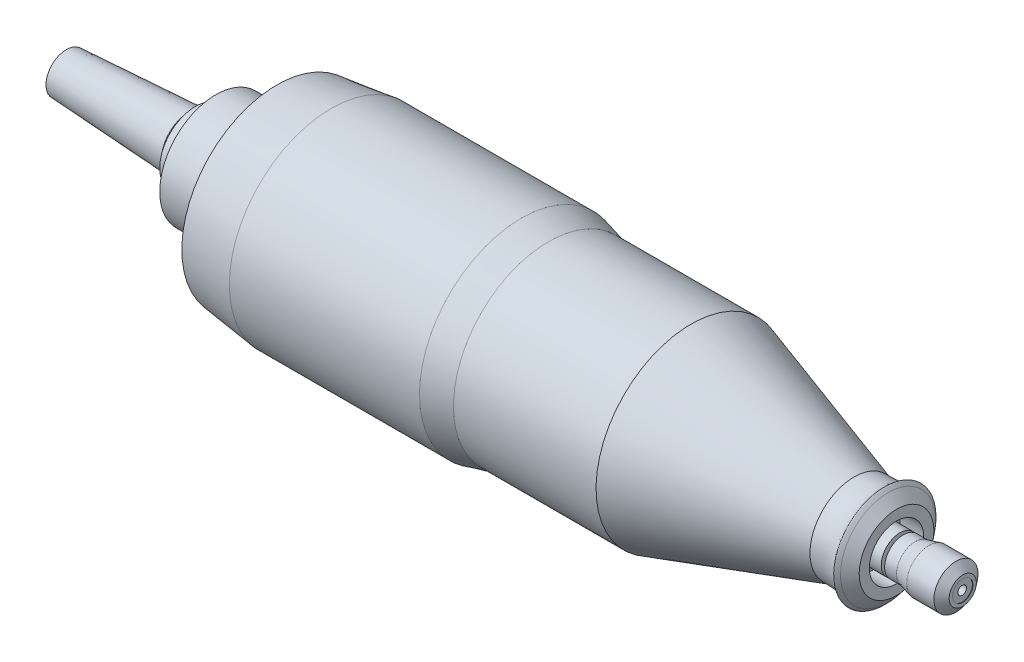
ISO-10303-21;
HEADER;
FILE_DESCRIPTION(('STEP AP214'),'2;1');
FILE_NAME('part.step','',(''),(''),'','','');
FILE_SCHEMA(('AUTOMOTIVE_DESIGN { 1 0 10303 214 1 1 1 1 }'));
ENDSEC;
DATA;
#1=APPLICATION_CONTEXT('core data for automotive mechanical design processes');
#2=APPLICATION_PROTOCOL_DEFINITION('international standard','automotive_design',2000,#1);
#3=PRODUCT_CONTEXT('',#1,'mechanical');
#4=PRODUCT('Part','Part','',(#3));
#5=PRODUCT_RELATED_PRODUCT_CATEGORY('part','',(#4));
#6=PRODUCT_DEFINITION_FORMATION('','',#4);
#7=PRODUCT_DEFINITION_CONTEXT('part definition',#1,'design');
#8=PRODUCT_DEFINITION('design','',#6,#7);
#9=PRODUCT_DEFINITION_SHAPE('','',#8);
#10=(LENGTH_UNIT() NAMED_UNIT(*) SI_UNIT(.MILLI.,.METRE.));
#11=(NAMED_UNIT(*) PLANE_ANGLE_UNIT() SI_UNIT($,.RADIAN.));
#12=(NAMED_UNIT(*) SI_UNIT($,.STERADIAN.) SOLID_ANGLE_UNIT());
#13=UNCERTAINTY_MEASURE_WITH_UNIT(LENGTH_MEASURE(1.E-05),#10,'distance_accuracy_value','');
#14=(GEOMETRIC_REPRESENTATION_CONTEXT(3) GLOBAL_UNCERTAINTY_ASSIGNED_CONTEXT((#13)) GLOBAL_UNIT_ASSIGNED_CONTEXT((#10,
#11,#12)) REPRESENTATION_CONTEXT('',''));
#15=CARTESIAN_POINT('',(0.,0.,0.));
#16=DIRECTION('',(0.,0.,1.));
#17=DIRECTION('',(1.,0.,0.));
#18=AXIS2_PLACEMENT_3D('',#15,#16,#17);
#19=CARTESIAN_POINT('',(187.735774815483,0.,0.));
#20=DIRECTION('',(-1.,0.,0.));
#21=DIRECTION('',(0.,-1.,0.));
#22=AXIS2_PLACEMENT_3D('',#19,#20,#21);
#23=CONICAL_SURFACE('',#22,8.73125,0.87605805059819);
#24=CARTESIAN_POINT('',(185.751399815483,0.,0.));
#25=DIRECTION('',(-1.,0.,0.));
#26=DIRECTION('',(0.,-1.,0.));
#27=AXIS2_PLACEMENT_3D('',#24,#25,#26);
#28=CIRCLE('',#27,11.1125);
#29=CARTESIAN_POINT('',(185.751399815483,-11.1125,0.));
#30=VERTEX_POINT('',#29);
#31=EDGE_CURVE('E10',#30,#30,#28,.T.);
#32=ORIENTED_EDGE('',*,*,#31,.F.);
#33=EDGE_LOOP('',(#32));
#34=FACE_BOUND('',#33,.T.);
#35=CARTESIAN_POINT('',(187.735774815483,0.,0.));
#36=DIRECTION('',(-1.,0.,0.));
#37=DIRECTION('',(0.,-1.,0.));
#38=AXIS2_PLACEMENT_3D('',#35,#36,#37);
#39=CIRCLE('',#38,8.73125);
#40=CARTESIAN_POINT('',(187.735774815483,-8.73125,0.));
#41=VERTEX_POINT('',#40);
#42=EDGE_CURVE('E120',#41,#41,#39,.T.);
#43=ORIENTED_EDGE('',*,*,#42,.T.);
#44=EDGE_LOOP('',(#43));
#45=FACE_BOUND('',#44,.T.);
#46=ADVANCED_FACE('F35',(#34,#45),#23,.T.);
#47=CARTESIAN_POINT('',(185.751399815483,11.1125,0.));
#48=CARTESIAN_POINT('',(184.596565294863,12.4397412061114,0.));
#49=CARTESIAN_POINT('',(185.538095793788,11.7385619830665,0.));
#50=CARTESIAN_POINT('',(182.922682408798,10.4257574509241,0.));
#51=CARTESIAN_POINT('',(181.187370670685,10.3726470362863,0.));
#52=CARTESIAN_POINT('',(177.813899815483,10.31875,0.));
#53=B_SPLINE_CURVE_WITH_KNOTS('',3,(#47,#48,#49,#50,#51,#52),.UNSPECIFIED.,.F.,.F.,(4,1,1,4),
(0.,0.659544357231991,0.859883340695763,1.),.UNSPECIFIED.);
#54=CARTESIAN_POINT('',(-6.33610018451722,0.,0.));
#55=DIRECTION('',(-1.,0.,0.));
#56=AXIS1_PLACEMENT('',#54,#55);
#57=SURFACE_OF_REVOLUTION('',#53,#56);
#58=CARTESIAN_POINT('',(177.813899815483,0.,0.));
#59=DIRECTION('',(-1.,0.,0.));
#60=DIRECTION('',(0.,-1.,0.));
#61=AXIS2_PLACEMENT_3D('',#58,#59,#60);
#62=CIRCLE('',#61,10.31875);
#63=CARTESIAN_POINT('',(177.813899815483,-10.31875,0.));
#64=VERTEX_POINT('',#63);
#65=EDGE_CURVE('E41',#64,#64,#62,.T.);
#66=ORIENTED_EDGE('',*,*,#65,.F.);
#67=EDGE_LOOP('',(#66));
#68=FACE_BOUND('',#67,.T.);
#69=ORIENTED_EDGE('',*,*,#31,.T.);
#70=EDGE_LOOP('',(#69));
#71=FACE_BOUND('',#70,.T.);
#72=ADVANCED_FACE('F133',(#68,#71),#57,.T.);
#73=CARTESIAN_POINT('',(177.813899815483,0.,0.));
#74=DIRECTION('',(-1.,0.,0.));
#75=DIRECTION('',(0.,-1.,0.));
#76=AXIS2_PLACEMENT_3D('',#73,#74,#75);
#77=CONICAL_SURFACE('',#76,10.31875,0.302884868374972);
#78=CARTESIAN_POINT('',(139.713899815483,0.,0.));
#79=DIRECTION('',(-1.,0.,0.));
#80=DIRECTION('',(0.,-1.,0.));
#81=AXIS2_PLACEMENT_3D('',#78,#79,#80);
#82=CIRCLE('',#81,22.225);
#83=CARTESIAN_POINT('',(139.713899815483,-22.225,0.));
#84=VERTEX_POINT('',#83);
#85=EDGE_CURVE('E45',#84,#84,#82,.T.);
#86=ORIENTED_EDGE('',*,*,#85,.F.);
#87=EDGE_LOOP('',(#86));
#88=FACE_BOUND('',#87,.T.);
#89=ORIENTED_EDGE('',*,*,#65,.T.);
#90=EDGE_LOOP('',(#89));
#91=FACE_BOUND('',#90,.T.);
#92=ADVANCED_FACE('F136',(#88,#91),#77,.T.);
#93=CARTESIAN_POINT('',(-6.33610018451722,0.,0.));
#94=DIRECTION('',(-1.,0.,0.));
#95=DIRECTION('',(0.,-1.,0.));
#96=AXIS2_PLACEMENT_3D('',#93,#94,#95);
#97=CYLINDRICAL_SURFACE('',#96,22.225);
#98=CARTESIAN_POINT('',(106.376399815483,0.,0.));
#99=DIRECTION('',(-1.,0.,0.));
#100=DIRECTION('',(0.,-1.,0.));
#101=AXIS2_PLACEMENT_3D('',#98,#99,#100);
#102=CIRCLE('',#101,22.225);
#103=CARTESIAN_POINT('',(106.376399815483,-22.225,0.));
#104=VERTEX_POINT('',#103);
#105=EDGE_CURVE('E49',#104,#104,#102,.T.);
#106=ORIENTED_EDGE('',*,*,#105,.F.);
#107=EDGE_LOOP('',(#106));
#108=FACE_BOUND('',#107,.T.);
#109=ORIENTED_EDGE('',*,*,#85,.T.);
#110=EDGE_LOOP('',(#109));
#111=FACE_BOUND('',#110,.T.);
#112=ADVANCED_FACE('F140',(#108,#111),#97,.T.);
#113=CARTESIAN_POINT('',(106.376399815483,0.,0.));
#114=DIRECTION('',(-1.,0.,0.));
#115=DIRECTION('',(0.,-1.,0.));
#116=AXIS2_PLACEMENT_3D('',#113,#114,#115);
#117=CONICAL_SURFACE('',#116,22.225,0.244978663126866);
#118=CARTESIAN_POINT('',(100.026399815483,0.,0.));
#119=DIRECTION('',(-1.,0.,0.));
#120=DIRECTION('',(0.,-1.,0.));
#121=AXIS2_PLACEMENT_3D('',#118,#119,#120);
#122=CIRCLE('',#121,23.8125);
#123=CARTESIAN_POINT('',(100.026399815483,-23.8125,0.));
#124=VERTEX_POINT('',#123);
#125=EDGE_CURVE('E54',#124,#124,#122,.T.);
#126=ORIENTED_EDGE('',*,*,#125,.F.);
#127=EDGE_LOOP('',(#126));
#128=FACE_BOUND('',#127,.T.);
#129=ORIENTED_EDGE('',*,*,#105,.T.);
#130=EDGE_LOOP('',(#129));
#131=FACE_BOUND('',#130,.T.);
#132=ADVANCED_FACE('F144',(#128,#131),#117,.T.);
#133=CARTESIAN_POINT('',(-6.33610018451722,0.,0.));
#134=DIRECTION('',(-1.,0.,0.));
#135=DIRECTION('',(0.,-1.,0.));
#136=AXIS2_PLACEMENT_3D('',#133,#134,#135);
#137=CYLINDRICAL_SURFACE('',#136,23.8125);
#138=CARTESIAN_POINT('',(55.5763998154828,0.,0.));
#139=DIRECTION('',(-1.,0.,0.));
#140=DIRECTION('',(0.,-1.,0.));
#141=AXIS2_PLACEMENT_3D('',#138,#139,#140);
#142=CIRCLE('',#141,23.8125);
#143=CARTESIAN_POINT('',(55.5763998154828,-23.8125,0.));
#144=VERTEX_POINT('',#143);
#145=EDGE_CURVE('E57',#144,#144,#142,.T.);
#146=ORIENTED_EDGE('',*,*,#145,.F.);
#147=EDGE_LOOP('',(#146));
#148=FACE_BOUND('',#147,.T.);
#149=ORIENTED_EDGE('',*,*,#125,.T.);
#150=EDGE_LOOP('',(#149));
#151=FACE_BOUND('',#150,.T.);
#152=ADVANCED_FACE('F148',(#148,#151),#137,.T.);
#153=CARTESIAN_POINT('',(55.5763998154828,0.,0.));
#154=DIRECTION('',(1.,0.,0.));
#155=DIRECTION('',(0.,1.,0.));
#156=AXIS2_PLACEMENT_3D('',#153,#154,#155);
#157=CONICAL_SURFACE('',#156,23.8125,0.124354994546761);
#158=CARTESIAN_POINT('',(42.8763998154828,0.,0.));
#159=DIRECTION('',(-1.,0.,0.));
#160=DIRECTION('',(0.,-1.,0.));
#161=AXIS2_PLACEMENT_3D('',#158,#159,#160);
#162=CIRCLE('',#161,22.225);
#163=CARTESIAN_POINT('',(42.8763998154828,-22.225,0.));
#164=VERTEX_POINT('',#163);
#165=EDGE_CURVE('E60',#164,#164,#162,.T.);
#166=ORIENTED_EDGE('',*,*,#165,.F.);
#167=EDGE_LOOP('',(#166));
#168=FACE_BOUND('',#167,.T.);
#169=ORIENTED_EDGE('',*,*,#145,.T.);
#170=EDGE_LOOP('',(#169));
#171=FACE_BOUND('',#170,.T.);
#172=ADVANCED_FACE('F152',(#168,#171),#157,.T.);
#173=CARTESIAN_POINT('',(36.5263998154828,0.,0.));
#174=DIRECTION('',(1.,0.,0.));
#175=DIRECTION('',(0.,1.,0.));
#176=AXIS2_PLACEMENT_3D('',#173,#174,#175);
#177=CONICAL_SURFACE('',#176,13.096875,0.962994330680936);
#178=ORIENTED_EDGE('',*,*,#165,.T.);
#179=EDGE_LOOP('',(#178));
#180=FACE_BOUND('',#179,.T.);
#181=CARTESIAN_POINT('',(36.5263998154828,0.,0.));
#182=DIRECTION('',(-1.,0.,0.));
#183=DIRECTION('',(0.,-1.,0.));
#184=AXIS2_PLACEMENT_3D('',#181,#182,#183);
#185=CIRCLE('',#184,13.096875);
#186=CARTESIAN_POINT('',(36.5263998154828,-13.096875,0.));
#187=VERTEX_POINT('',#186);
#188=EDGE_CURVE('E63',#187,#187,#185,.T.);
#189=ORIENTED_EDGE('',*,*,#188,.F.);
#190=EDGE_LOOP('',(#189));
#191=FACE_BOUND('',#190,.T.);
#192=ADVANCED_FACE('F156',(#180,#191),#177,.T.);
#193=CARTESIAN_POINT('',(-6.33610018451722,0.,0.));
#194=DIRECTION('',(-1.,0.,0.));
#195=DIRECTION('',(0.,-1.,0.));
#196=AXIS2_PLACEMENT_3D('',#193,#194,#195);
#197=CYLINDRICAL_SURFACE('',#196,13.096875);
#198=CARTESIAN_POINT('',(28.5888998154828,0.,0.));
#199=DIRECTION('',(-1.,0.,0.));
#200=DIRECTION('',(0.,-1.,0.));
#201=AXIS2_PLACEMENT_3D('',#198,#199,#200);
#202=CIRCLE('',#201,13.096875);
#203=CARTESIAN_POINT('',(28.5888998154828,-13.096875,0.));
#204=VERTEX_POINT('',#203);
#205=EDGE_CURVE('E66',#204,#204,#202,.T.);
#206=ORIENTED_EDGE('',*,*,#205,.F.);
#207=EDGE_LOOP('',(#206));
#208=FACE_BOUND('',#207,.T.);
#209=ORIENTED_EDGE('',*,*,#188,.T.);
#210=EDGE_LOOP('',(#209));
#211=FACE_BOUND('',#210,.T.);
#212=ADVANCED_FACE('F160',(#208,#211),#197,.T.);
#213=CARTESIAN_POINT('',(28.5888998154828,0.,0.));
#214=DIRECTION('',(1.,0.,0.));
#215=DIRECTION('',(0.,1.,0.));
#216=AXIS2_PLACEMENT_3D('',#213,#214,#215);
#217=PLANE('',#216);
#218=CARTESIAN_POINT('',(28.5888998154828,0.,0.));
#219=DIRECTION('',(-1.,0.,0.));
#220=DIRECTION('',(0.,-1.,0.));
#221=AXIS2_PLACEMENT_3D('',#218,#219,#220);
#222=CIRCLE('',#221,8.334375);
#223=CARTESIAN_POINT('',(28.5888998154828,-8.334375,0.));
#224=VERTEX_POINT('',#223);
#225=EDGE_CURVE('E69',#224,#224,#222,.T.);
#226=ORIENTED_EDGE('',*,*,#225,.F.);
#227=EDGE_LOOP('',(#226));
#228=FACE_BOUND('',#227,.T.);
#229=ORIENTED_EDGE('',*,*,#205,.T.);
#230=EDGE_LOOP('',(#229));
#231=FACE_BOUND('',#230,.T.);
#232=ADVANCED_FACE('F164',(#228,#231),#217,.F.);
#233=CARTESIAN_POINT('',(-6.33610018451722,0.,0.));
#234=DIRECTION('',(-1.,0.,0.));
#235=DIRECTION('',(0.,-1.,0.));
#236=AXIS2_PLACEMENT_3D('',#233,#234,#235);
#237=CYLINDRICAL_SURFACE('',#236,8.334375);
#238=CARTESIAN_POINT('',(23.8263998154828,0.,0.));
#239=DIRECTION('',(-1.,0.,0.));
#240=DIRECTION('',(0.,-1.,0.));
#241=AXIS2_PLACEMENT_3D('',#238,#239,#240);
#242=CIRCLE('',#241,8.334375);
#243=CARTESIAN_POINT('',(23.8263998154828,-8.334375,0.));
#244=VERTEX_POINT('',#243);
#245=EDGE_CURVE('E72',#244,#244,#242,.T.);
#246=ORIENTED_EDGE('',*,*,#245,.F.);
#247=EDGE_LOOP('',(#246));
#248=FACE_BOUND('',#247,.T.);
#249=ORIENTED_EDGE('',*,*,#225,.T.);
#250=EDGE_LOOP('',(#249));
#251=FACE_BOUND('',#250,.T.);
#252=ADVANCED_FACE('F168',(#248,#251),#237,.T.);
#253=CARTESIAN_POINT('',(23.8263998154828,0.,0.));
#254=DIRECTION('',(1.,0.,0.));
#255=DIRECTION('',(0.,1.,0.));
#256=AXIS2_PLACEMENT_3D('',#253,#254,#255);
#257=CONICAL_SURFACE('',#256,8.334375,0.896055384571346);
#258=CARTESIAN_POINT('',(22.2388998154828,0.,0.));
#259=DIRECTION('',(-1.,0.,0.));
#260=DIRECTION('',(0.,-1.,0.));
#261=AXIS2_PLACEMENT_3D('',#258,#259,#260);
#262=CIRCLE('',#261,6.35);
#263=CARTESIAN_POINT('',(22.2388998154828,-6.35,0.));
#264=VERTEX_POINT('',#263);
#265=EDGE_CURVE('E75',#264,#264,#262,.T.);
#266=ORIENTED_EDGE('',*,*,#265,.F.);
#267=EDGE_LOOP('',(#266));
#268=FACE_BOUND('',#267,.T.);
#269=ORIENTED_EDGE('',*,*,#245,.T.);
#270=EDGE_LOOP('',(#269));
#271=FACE_BOUND('',#270,.T.);
#272=ADVANCED_FACE('F172',(#268,#271),#257,.T.);
#273=CARTESIAN_POINT('',(22.2388998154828,0.,0.));
#274=DIRECTION('',(1.,0.,0.));
#275=DIRECTION('',(0.,1.,0.));
#276=AXIS2_PLACEMENT_3D('',#273,#274,#275);
#277=CONICAL_SURFACE('',#276,6.35,0.0554985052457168);
#278=CARTESIAN_POINT('',(-6.33610018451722,0.,0.));
#279=DIRECTION('',(-1.,0.,0.));
#280=DIRECTION('',(0.,-1.,0.));
#281=AXIS2_PLACEMENT_3D('',#278,#279,#280);
#282=CIRCLE('',#281,4.7625);
#283=CARTESIAN_POINT('',(-6.33610018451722,-4.7625,0.));
#284=VERTEX_POINT('',#283);
#285=EDGE_CURVE('E78',#284,#284,#282,.T.);
#286=ORIENTED_EDGE('',*,*,#285,.F.);
#287=EDGE_LOOP('',(#286));
#288=FACE_BOUND('',#287,.T.);
#289=ORIENTED_EDGE('',*,*,#265,.T.);
#290=EDGE_LOOP('',(#289));
#291=FACE_BOUND('',#290,.T.);
#292=ADVANCED_FACE('F176',(#288,#291),#277,.T.);
#293=CARTESIAN_POINT('',(-6.33610018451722,0.,0.));
#294=DIRECTION('',(1.,0.,0.));
#295=DIRECTION('',(0.,1.,0.));
#296=AXIS2_PLACEMENT_3D('',#293,#294,#295);
#297=PLANE('',#296);
#298=ORIENTED_EDGE('',*,*,#285,.T.);
#299=EDGE_LOOP('',(#298));
#300=FACE_BOUND('',#299,.T.);
#301=ADVANCED_FACE('F180',(#300),#297,.F.);
#302=CARTESIAN_POINT('',(203.086165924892,0.,0.));
#303=DIRECTION('',(1.,0.,0.));
#304=DIRECTION('',(0.,1.,0.));
#305=AXIS2_PLACEMENT_3D('',#302,#303,#304);
#306=PLANE('',#305);
#307=CARTESIAN_POINT('',(203.086165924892,0.,0.));
#308=DIRECTION('',(1.,0.,0.));
#309=DIRECTION('',(0.,1.,0.));
#310=AXIS2_PLACEMENT_3D('',#307,#308,#309);
#311=CIRCLE('',#310,1.016);
#312=CARTESIAN_POINT('',(203.086165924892,1.016,0.));
#313=VERTEX_POINT('',#312);
#314=EDGE_CURVE('E128',#313,#313,#311,.T.);
#315=ORIENTED_EDGE('',*,*,#314,.F.);
#316=EDGE_LOOP('',(#315));
#317=FACE_BOUND('',#316,.T.);
#318=CARTESIAN_POINT('',(203.086165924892,0.,0.));
#319=DIRECTION('',(-1.,0.,0.));
#320=DIRECTION('',(0.,-1.,0.));
#321=AXIS2_PLACEMENT_3D('',#318,#319,#320);
#322=CIRCLE('',#321,2.38125);
#323=CARTESIAN_POINT('',(203.086165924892,-2.38125,0.));
#324=VERTEX_POINT('',#323);
#325=EDGE_CURVE('E81',#324,#324,#322,.T.);
#326=ORIENTED_EDGE('',*,*,#325,.F.);
#327=EDGE_LOOP('',(#326));
#328=FACE_BOUND('',#327,.T.);
#329=ADVANCED_FACE('F184',(#317,#328),#306,.T.);
#330=CARTESIAN_POINT('',(-6.33610018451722,0.,0.));
#331=DIRECTION('',(-1.,0.,0.));
#332=DIRECTION('',(0.,-1.,0.));
#333=AXIS2_PLACEMENT_3D('',#330,#331,#332);
#334=CYLINDRICAL_SURFACE('',#333,2.38125);
#335=ORIENTED_EDGE('',*,*,#325,.T.);
#336=EDGE_LOOP('',(#335));
#337=FACE_BOUND('',#336,.T.);
#338=CARTESIAN_POINT('',(203.213899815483,0.,0.));
#339=DIRECTION('',(-1.,0.,0.));
#340=DIRECTION('',(0.,-1.,0.));
#341=AXIS2_PLACEMENT_3D('',#338,#339,#340);
#342=CIRCLE('',#341,2.38125);
#343=CARTESIAN_POINT('',(203.213899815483,-2.38125,0.));
#344=VERTEX_POINT('',#343);
#345=EDGE_CURVE('E84',#344,#344,#342,.T.);
#346=ORIENTED_EDGE('',*,*,#345,.F.);
#347=EDGE_LOOP('',(#346));
#348=FACE_BOUND('',#347,.T.);
#349=ADVANCED_FACE('F188',(#337,#348),#334,.F.);
#350=CARTESIAN_POINT('',(203.213899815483,0.,0.));
#351=DIRECTION('',(1.,0.,0.));
#352=DIRECTION('',(0.,1.,0.));
#353=AXIS2_PLACEMENT_3D('',#350,#351,#352);
#354=PLANE('',#353);
#355=ORIENTED_EDGE('',*,*,#345,.T.);
#356=EDGE_LOOP('',(#355));
#357=FACE_BOUND('',#356,.T.);
#358=CARTESIAN_POINT('',(203.213899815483,0.,0.));
#359=DIRECTION('',(-1.,0.,0.));
#360=DIRECTION('',(0.,-1.,0.));
#361=AXIS2_PLACEMENT_3D('',#358,#359,#360);
#362=CIRCLE('',#361,3.175);
#363=CARTESIAN_POINT('',(203.213899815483,-3.175,0.));
#364=VERTEX_POINT('',#363);
#365=EDGE_CURVE('E87',#364,#364,#362,.T.);
#366=ORIENTED_EDGE('',*,*,#365,.F.);
#367=EDGE_LOOP('',(#366));
#368=FACE_BOUND('',#367,.T.);
#369=ADVANCED_FACE('F192',(#357,#368),#354,.T.);
#370=CARTESIAN_POINT('',(203.213899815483,0.,0.));
#371=DIRECTION('',(-1.,0.,0.));
#372=DIRECTION('',(0.,-1.,0.));
#373=AXIS2_PLACEMENT_3D('',#370,#371,#372);
#374=CONICAL_SURFACE('',#373,3.175,0.896055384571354);
#375=CARTESIAN_POINT('',(201.626399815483,0.,0.));
#376=DIRECTION('',(-1.,0.,0.));
#377=DIRECTION('',(0.,-1.,0.));
#378=AXIS2_PLACEMENT_3D('',#375,#376,#377);
#379=CIRCLE('',#378,5.15937499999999);
#380=CARTESIAN_POINT('',(201.626399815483,-5.15937499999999,0.));
#381=VERTEX_POINT('',#380);
#382=EDGE_CURVE('E90',#381,#381,#379,.T.);
#383=ORIENTED_EDGE('',*,*,#382,.F.);
#384=EDGE_LOOP('',(#383));
#385=FACE_BOUND('',#384,.T.);
#386=ORIENTED_EDGE('',*,*,#365,.T.);
#387=EDGE_LOOP('',(#386));
#388=FACE_BOUND('',#387,.T.);
#389=ADVANCED_FACE('F196',(#385,#388),#374,.T.);
#390=CARTESIAN_POINT('',(-6.33610018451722,0.,0.));
#391=DIRECTION('',(-1.,0.,0.));
#392=DIRECTION('',(0.,-1.,0.));
#393=AXIS2_PLACEMENT_3D('',#390,#391,#392);
#394=CYLINDRICAL_SURFACE('',#393,5.159375);
#395=CARTESIAN_POINT('',(195.276399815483,0.,0.));
#396=DIRECTION('',(-1.,0.,0.));
#397=DIRECTION('',(0.,-1.,0.));
#398=AXIS2_PLACEMENT_3D('',#395,#396,#397);
#399=CIRCLE('',#398,5.159375);
#400=CARTESIAN_POINT('',(195.276399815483,-5.159375,0.));
#401=VERTEX_POINT('',#400);
#402=EDGE_CURVE('E93',#401,#401,#399,.T.);
#403=ORIENTED_EDGE('',*,*,#402,.F.);
#404=EDGE_LOOP('',(#403));
#405=FACE_BOUND('',#404,.T.);
#406=ORIENTED_EDGE('',*,*,#382,.T.);
#407=EDGE_LOOP('',(#406));
#408=FACE_BOUND('',#407,.T.);
#409=ADVANCED_FACE('F200',(#405,#408),#394,.T.);
#410=CARTESIAN_POINT('',(195.276399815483,0.,0.));
#411=DIRECTION('',(1.,0.,0.));
#412=DIRECTION('',(0.,1.,0.));
#413=AXIS2_PLACEMENT_3D('',#410,#411,#412);
#414=CONICAL_SURFACE('',#413,5.159375,0.244978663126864);
#415=CARTESIAN_POINT('',(192.101399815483,0.,0.));
#416=DIRECTION('',(-1.,0.,0.));
#417=DIRECTION('',(0.,-1.,0.));
#418=AXIS2_PLACEMENT_3D('',#415,#416,#417);
#419=CIRCLE('',#418,4.365625);
#420=CARTESIAN_POINT('',(192.101399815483,-4.365625,0.));
#421=VERTEX_POINT('',#420);
#422=EDGE_CURVE('E96',#421,#421,#419,.T.);
#423=ORIENTED_EDGE('',*,*,#422,.F.);
#424=EDGE_LOOP('',(#423));
#425=FACE_BOUND('',#424,.T.);
#426=ORIENTED_EDGE('',*,*,#402,.T.);
#427=EDGE_LOOP('',(#426));
#428=FACE_BOUND('',#427,.T.);
#429=ADVANCED_FACE('F204',(#425,#428),#414,.T.);
#430=CARTESIAN_POINT('',(-6.33610018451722,0.,0.));
#431=DIRECTION('',(-1.,0.,0.));
#432=DIRECTION('',(0.,-1.,0.));
#433=AXIS2_PLACEMENT_3D('',#430,#431,#432);
#434=CYLINDRICAL_SURFACE('',#433,4.365625);
#435=CARTESIAN_POINT('',(189.323274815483,0.,0.));
#436=DIRECTION('',(-1.,0.,0.));
#437=DIRECTION('',(0.,-1.,0.));
#438=AXIS2_PLACEMENT_3D('',#435,#436,#437);
#439=CIRCLE('',#438,4.365625);
#440=CARTESIAN_POINT('',(189.323274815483,-4.365625,0.));
#441=VERTEX_POINT('',#440);
#442=EDGE_CURVE('E99',#441,#441,#439,.T.);
#443=ORIENTED_EDGE('',*,*,#442,.F.);
#444=EDGE_LOOP('',(#443));
#445=FACE_BOUND('',#444,.T.);
#446=ORIENTED_EDGE('',*,*,#422,.T.);
#447=EDGE_LOOP('',(#446));
#448=FACE_BOUND('',#447,.T.);
#449=ADVANCED_FACE('F208',(#445,#448),#434,.T.);
#450=CARTESIAN_POINT('',(189.323274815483,0.,0.));
#451=DIRECTION('',(1.,0.,0.));
#452=DIRECTION('',(0.,1.,0.));
#453=AXIS2_PLACEMENT_3D('',#450,#451,#452);
#454=PLANE('',#453);
#455=CARTESIAN_POINT('',(189.323274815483,0.,0.));
#456=DIRECTION('',(-1.,0.,0.));
#457=DIRECTION('',(0.,-1.,0.));
#458=AXIS2_PLACEMENT_3D('',#455,#456,#457);
#459=CIRCLE('',#458,3.175);
#460=CARTESIAN_POINT('',(189.323274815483,-3.175,0.));
#461=VERTEX_POINT('',#460);
#462=EDGE_CURVE('E102',#461,#461,#459,.T.);
#463=ORIENTED_EDGE('',*,*,#462,.F.);
#464=EDGE_LOOP('',(#463));
#465=FACE_BOUND('',#464,.T.);
#466=ORIENTED_EDGE('',*,*,#442,.T.);
#467=EDGE_LOOP('',(#466));
#468=FACE_BOUND('',#467,.T.);
#469=ADVANCED_FACE('F212',(#465,#468),#454,.F.);
#470=CARTESIAN_POINT('',(-6.33610018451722,0.,0.));
#471=DIRECTION('',(-1.,0.,0.));
#472=DIRECTION('',(0.,-1.,0.));
#473=AXIS2_PLACEMENT_3D('',#470,#471,#472);
#474=CYLINDRICAL_SURFACE('',#473,3.175);
#475=CARTESIAN_POINT('',(188.529524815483,0.,0.));
#476=DIRECTION('',(-1.,0.,0.));
#477=DIRECTION('',(0.,-1.,0.));
#478=AXIS2_PLACEMENT_3D('',#475,#476,#477);
#479=CIRCLE('',#478,3.175);
#480=CARTESIAN_POINT('',(188.529524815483,-3.175,0.));
#481=VERTEX_POINT('',#480);
#482=EDGE_CURVE('E105',#481,#481,#479,.T.);
#483=ORIENTED_EDGE('',*,*,#482,.F.);
#484=EDGE_LOOP('',(#483));
#485=FACE_BOUND('',#484,.T.);
#486=ORIENTED_EDGE('',*,*,#462,.T.);
#487=EDGE_LOOP('',(#486));
#488=FACE_BOUND('',#487,.T.);
#489=ADVANCED_FACE('F216',(#485,#488),#474,.T.);
#490=CARTESIAN_POINT('',(188.529524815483,0.,0.));
#491=DIRECTION('',(-1.,0.,0.));
#492=DIRECTION('',(0.,-1.,0.));
#493=AXIS2_PLACEMENT_3D('',#490,#491,#492);
#494=PLANE('',#493);
#495=CARTESIAN_POINT('',(188.529524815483,0.,0.));
#496=DIRECTION('',(-1.,0.,0.));
#497=DIRECTION('',(0.,-1.,0.));
#498=AXIS2_PLACEMENT_3D('',#495,#496,#497);
#499=CIRCLE('',#498,4.365625);
#500=CARTESIAN_POINT('',(188.529524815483,-4.365625,0.));
#501=VERTEX_POINT('',#500);
#502=EDGE_CURVE('E108',#501,#501,#499,.T.);
#503=ORIENTED_EDGE('',*,*,#502,.F.);
#504=EDGE_LOOP('',(#503));
#505=FACE_BOUND('',#504,.T.);
#506=ORIENTED_EDGE('',*,*,#482,.T.);
#507=EDGE_LOOP('',(#506));
#508=FACE_BOUND('',#507,.T.);
#509=ADVANCED_FACE('F220',(#505,#508),#494,.F.);
#510=CARTESIAN_POINT('',(-6.33610018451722,0.,0.));
#511=DIRECTION('',(-1.,0.,0.));
#512=DIRECTION('',(0.,-1.,0.));
#513=AXIS2_PLACEMENT_3D('',#510,#511,#512);
#514=CYLINDRICAL_SURFACE('',#513,4.365625);
#515=CARTESIAN_POINT('',(182.179524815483,0.,0.));
#516=DIRECTION('',(-1.,0.,0.));
#517=DIRECTION('',(0.,-1.,0.));
#518=AXIS2_PLACEMENT_3D('',#515,#516,#517);
#519=CIRCLE('',#518,4.365625);
#520=CARTESIAN_POINT('',(182.179524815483,-4.365625,0.));
#521=VERTEX_POINT('',#520);
#522=EDGE_CURVE('E111',#521,#521,#519,.T.);
#523=ORIENTED_EDGE('',*,*,#522,.F.);
#524=EDGE_LOOP('',(#523));
#525=FACE_BOUND('',#524,.T.);
#526=ORIENTED_EDGE('',*,*,#502,.T.);
#527=EDGE_LOOP('',(#526));
#528=FACE_BOUND('',#527,.T.);
#529=ADVANCED_FACE('F224',(#525,#528),#514,.T.);
#530=CARTESIAN_POINT('',(182.179524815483,0.,0.));
#531=DIRECTION('',(-1.,0.,0.));
#532=DIRECTION('',(0.,-1.,0.));
#533=AXIS2_PLACEMENT_3D('',#530,#531,#532);
#534=PLANE('',#533);
#535=CARTESIAN_POINT('',(182.179524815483,0.,0.));
#536=DIRECTION('',(-1.,0.,0.));
#537=DIRECTION('',(0.,-1.,0.));
#538=AXIS2_PLACEMENT_3D('',#535,#536,#537);
#539=CIRCLE('',#538,6.35);
#540=CARTESIAN_POINT('',(182.179524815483,-6.35,0.));
#541=VERTEX_POINT('',#540);
#542=EDGE_CURVE('E114',#541,#541,#539,.T.);
#543=ORIENTED_EDGE('',*,*,#542,.F.);
#544=EDGE_LOOP('',(#543));
#545=FACE_BOUND('',#544,.T.);
#546=ORIENTED_EDGE('',*,*,#522,.T.);
#547=EDGE_LOOP('',(#546));
#548=FACE_BOUND('',#547,.T.);
#549=ADVANCED_FACE('F228',(#545,#548),#534,.F.);
#550=CARTESIAN_POINT('',(-6.33610018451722,0.,0.));
#551=DIRECTION('',(-1.,0.,0.));
#552=DIRECTION('',(0.,-1.,0.));
#553=AXIS2_PLACEMENT_3D('',#550,#551,#552);
#554=CYLINDRICAL_SURFACE('',#553,6.35);
#555=CARTESIAN_POINT('',(187.735774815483,0.,0.));
#556=DIRECTION('',(-1.,0.,0.));
#557=DIRECTION('',(0.,-1.,0.));
#558=AXIS2_PLACEMENT_3D('',#555,#556,#557);
#559=CIRCLE('',#558,6.35);
#560=CARTESIAN_POINT('',(187.735774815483,-6.35,0.));
#561=VERTEX_POINT('',#560);
#562=EDGE_CURVE('E117',#561,#561,#559,.T.);
#563=ORIENTED_EDGE('',*,*,#562,.F.);
#564=EDGE_LOOP('',(#563));
#565=FACE_BOUND('',#564,.T.);
#566=ORIENTED_EDGE('',*,*,#542,.T.);
#567=EDGE_LOOP('',(#566));
#568=FACE_BOUND('',#567,.T.);
#569=ADVANCED_FACE('F232',(#565,#568),#554,.F.);
#570=CARTESIAN_POINT('',(187.735774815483,0.,0.));
#571=DIRECTION('',(-1.,0.,0.));
#572=DIRECTION('',(0.,-1.,0.));
#573=AXIS2_PLACEMENT_3D('',#570,#571,#572);
#574=PLANE('',#573);
#575=ORIENTED_EDGE('',*,*,#42,.F.);
#576=EDGE_LOOP('',(#575));
#577=FACE_BOUND('',#576,.T.);
#578=ORIENTED_EDGE('',*,*,#562,.T.);
#579=EDGE_LOOP('',(#578));
#580=FACE_BOUND('',#579,.T.);
#581=ADVANCED_FACE('F236',(#577,#580),#574,.F.);
#582=CARTESIAN_POINT('',(200.546165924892,0.,0.));
#583=DIRECTION('',(1.,0.,0.));
#584=DIRECTION('',(0.,1.,0.));
#585=AXIS2_PLACEMENT_3D('',#582,#583,#584);
#586=CYLINDRICAL_SURFACE('',#585,1.016);
#587=CARTESIAN_POINT('',(200.546165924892,0.,0.));
#588=DIRECTION('',(1.,0.,0.));
#589=DIRECTION('',(0.,1.,0.));
#590=AXIS2_PLACEMENT_3D('',#587,#588,#589);
#591=CIRCLE('',#590,1.016);
#592=CARTESIAN_POINT('',(200.546165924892,1.016,0.));
#593=VERTEX_POINT('',#592);
#594=EDGE_CURVE('E123',#593,#593,#591,.T.);
#595=ORIENTED_EDGE('',*,*,#594,.F.);
#596=EDGE_LOOP('',(#595));
#597=FACE_BOUND('',#596,.T.);
#598=ORIENTED_EDGE('',*,*,#314,.T.);
#599=EDGE_LOOP('',(#598));
#600=FACE_BOUND('',#599,.T.);
#601=ADVANCED_FACE('F240',(#597,#600),#586,.F.);
#602=CARTESIAN_POINT('',(200.546165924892,0.,0.));
#603=DIRECTION('',(1.,0.,0.));
#604=DIRECTION('',(0.,1.,0.));
#605=AXIS2_PLACEMENT_3D('',#602,#603,#604);
#606=PLANE('',#605);
#607=ORIENTED_EDGE('',*,*,#594,.T.);
#608=EDGE_LOOP('',(#607));
#609=FACE_BOUND('',#608,.T.);
#610=ADVANCED_FACE('F244',(#609),#606,.T.);
#611=CLOSED_SHELL('',(#46,#72,#92,#112,#132,#152,#172,#192,#212,#232,#252,#272,#292,#301,#329,
#349,#369,#389,#409,#429,#449,#469,#489,#509,#529,#549,#569,#581,#601,#610));
#612=MANIFOLD_SOLID_BREP('B2',#611);
#613=ADVANCED_BREP_SHAPE_REPRESENTATION('',(#18,#612),#14);
#614=SHAPE_DEFINITION_REPRESENTATION(#9,#613);
ENDSEC;
END-ISO-10303-21;
